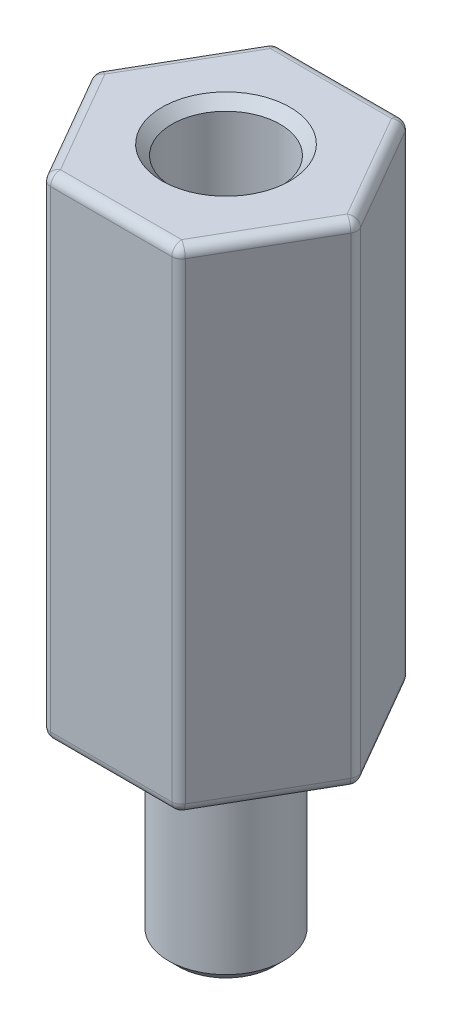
from build123d import *

# Parameters (mm, degrees)
SKETCH1_R           = 1.65
BOSS_EXTRUDE1_DEPTH = 15
FILLET1_R           = 0.3
FILLET2_R           = 0.3
SKETCH2_R           = 1.75
BOSS_EXTRUDE2_DEPTH = 6
CHAMFER1_SIZE       = 0.3
FILLET3_R           = 0.3


with BuildPart() as part:
    # Sketch1 → Boss-Extrude1 (new body)
    with BuildSketch(Plane(origin=(0, 0, 0), x_dir=(1, 0, 0), z_dir=(0, 1, 0))):
        Polygon((-2.020725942, 3.5), (-4.041451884, 0), (-2.020725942, -3.5), (2.020725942, -3.5), (4.041451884, 0), (2.020725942, 3.5), align=None)
        with Locations(Location((0, 0, 0), (0, 0, 270))):
            Circle(SKETCH1_R, mode=Mode.SUBTRACT)
    extrude(amount=BOSS_EXTRUDE1_DEPTH)

    # Fillet1
    fillet1_edges = [part.edges().sort_by_distance(p)[0] for p in [
        (2.020725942, 7.5, -3.5),
        (4.041451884, 7.5, 0),
        (2.020725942, 7.5, 3.5),
        (-2.020725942, 7.5, 3.5),
        (-4.041451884, 7.5, 0),
        (-2.020725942, 7.5, -3.5),
    ]]
    fillet(fillet1_edges, radius=FILLET1_R)

    # Fillet2
    fillet2_edges = [part.edges().sort_by_distance(p)[0] for p in [
        (0, 0, -3.5),
        (0, 15, -3.5),
        (3.031088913, 0, -1.75),
        (3.031088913, 0, 1.75),
        (0, 0, 3.5),
        (-3.031088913, 0, 1.75),
        (-3.031088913, 0, -1.75),
        (1.997520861, 0, 3.459807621),
        (-1.997520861, 0, 3.459807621),
        (-3.995041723, 0, 0),
        (-1.997520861, 0, -3.459807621),
        (3.995041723, 0, 0),
        (1.997520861, 0, -3.459807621),
        (3.031088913, 15, -1.75),
        (-3.031088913, 15, -1.75),
        (-3.031088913, 15, 1.75),
        (0, 15, 3.5),
        (3.031088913, 15, 1.75),
        (1.997520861, 15, 3.459807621),
        (-1.997520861, 15, 3.459807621),
        (-3.995041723, 15, 0),
        (-1.997520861, 15, -3.459807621),
        (3.995041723, 15, 0),
        (1.997520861, 15, -3.459807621),
    ]]
    fillet(fillet2_edges, radius=FILLET2_R)

    # Sketch2 → Boss-Extrude2 (add)
    with BuildSketch(Plane.XZ):
        with Locations(Location((0, 0, 0), (0, 0, 90))):
            Circle(SKETCH2_R)
    extrude(amount=BOSS_EXTRUDE2_DEPTH)

    # Chamfer1
    chamfer1_edges = [part.edges().sort_by_distance(p)[0] for p in [
        (0, -6, -1.75),
        (0, 15, -1.65),
    ]]
    chamfer(chamfer1_edges, length=CHAMFER1_SIZE)

    # Fillet3
    fillet3_edges = [part.edges().sort_by_distance(p)[0] for p in [
        (0, 0, -1.75),
    ]]
    fillet(fillet3_edges, radius=FILLET3_R)


solid = part.part
